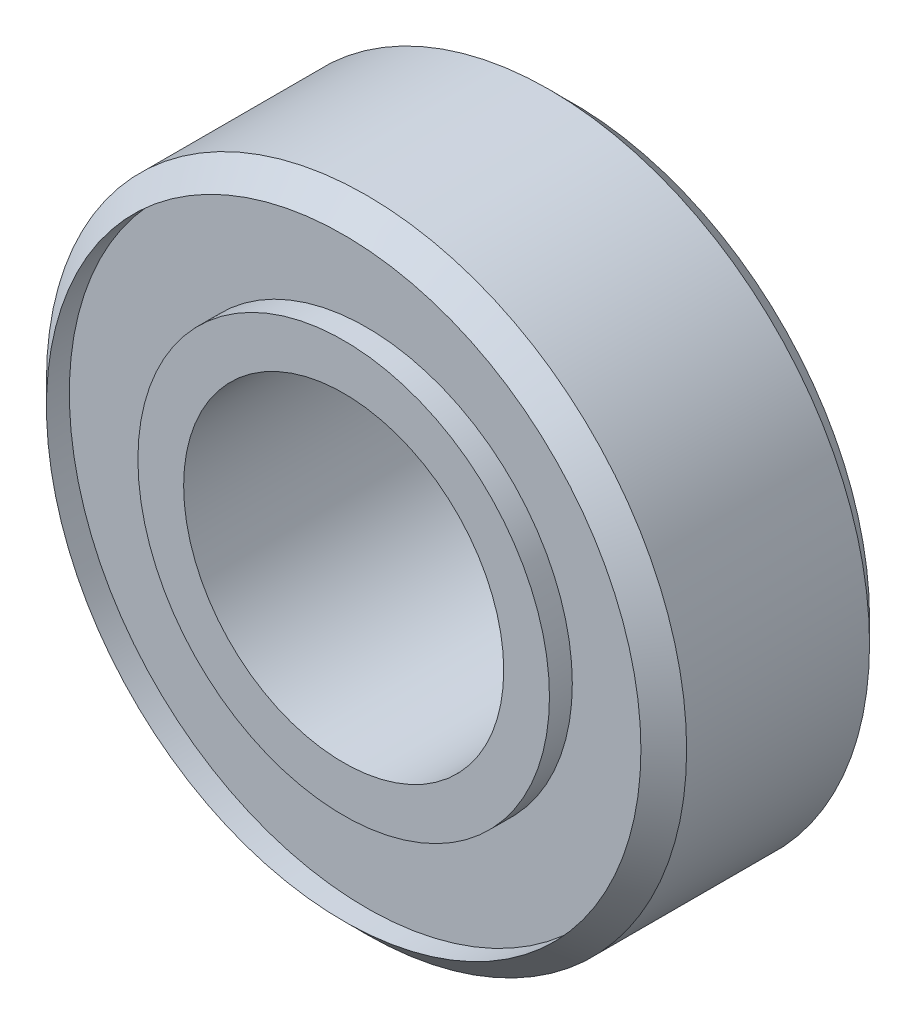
ISO-10303-21;
HEADER;
FILE_DESCRIPTION(('STEP AP214'),'2;1');
FILE_NAME('part.step','',(''),(''),'','','');
FILE_SCHEMA(('AUTOMOTIVE_DESIGN { 1 0 10303 214 1 1 1 1 }'));
ENDSEC;
DATA;
#1=APPLICATION_CONTEXT('core data for automotive mechanical design processes');
#2=APPLICATION_PROTOCOL_DEFINITION('international standard','automotive_design',2000,#1);
#3=PRODUCT_CONTEXT('',#1,'mechanical');
#4=PRODUCT('Part','Part','',(#3));
#5=PRODUCT_RELATED_PRODUCT_CATEGORY('part','',(#4));
#6=PRODUCT_DEFINITION_FORMATION('','',#4);
#7=PRODUCT_DEFINITION_CONTEXT('part definition',#1,'design');
#8=PRODUCT_DEFINITION('design','',#6,#7);
#9=PRODUCT_DEFINITION_SHAPE('','',#8);
#10=(LENGTH_UNIT() NAMED_UNIT(*) SI_UNIT(.MILLI.,.METRE.));
#11=(NAMED_UNIT(*) PLANE_ANGLE_UNIT() SI_UNIT($,.RADIAN.));
#12=(NAMED_UNIT(*) SI_UNIT($,.STERADIAN.) SOLID_ANGLE_UNIT());
#13=UNCERTAINTY_MEASURE_WITH_UNIT(LENGTH_MEASURE(1.E-05),#10,'distance_accuracy_value','');
#14=(GEOMETRIC_REPRESENTATION_CONTEXT(3) GLOBAL_UNCERTAINTY_ASSIGNED_CONTEXT((#13)) GLOBAL_UNIT_ASSIGNED_CONTEXT((#10,
#11,#12)) REPRESENTATION_CONTEXT('',''));
#15=CARTESIAN_POINT('',(0.,0.,0.));
#16=DIRECTION('',(0.,0.,1.));
#17=DIRECTION('',(1.,0.,0.));
#18=AXIS2_PLACEMENT_3D('',#15,#16,#17);
#19=CARTESIAN_POINT('',(0.,0.,0.));
#20=DIRECTION('',(0.,0.,1.));
#21=DIRECTION('',(1.,0.,0.));
#22=AXIS2_PLACEMENT_3D('',#19,#20,#21);
#23=PLANE('',#22);
#24=CARTESIAN_POINT('',(0.,0.,0.));
#25=DIRECTION('',(0.,0.,1.));
#26=DIRECTION('',(1.,0.,0.));
#27=AXIS2_PLACEMENT_3D('',#24,#25,#26);
#28=CIRCLE('',#27,3.5);
#29=CARTESIAN_POINT('',(3.5,0.,0.));
#30=VERTEX_POINT('',#29);
#31=EDGE_CURVE('E45',#30,#30,#28,.T.);
#32=ORIENTED_EDGE('',*,*,#31,.T.);
#33=EDGE_LOOP('',(#32));
#34=FACE_BOUND('',#33,.T.);
#35=CARTESIAN_POINT('',(0.,0.,0.));
#36=DIRECTION('',(0.,0.,-1.));
#37=DIRECTION('',(-1.,0.,0.));
#38=AXIS2_PLACEMENT_3D('',#35,#36,#37);
#39=CIRCLE('',#38,4.5);
#40=CARTESIAN_POINT('',(-4.5,0.,0.));
#41=VERTEX_POINT('',#40);
#42=EDGE_CURVE('E71',#41,#41,#39,.T.);
#43=ORIENTED_EDGE('',*,*,#42,.T.);
#44=EDGE_LOOP('',(#43));
#45=FACE_BOUND('',#44,.T.);
#46=ADVANCED_FACE('F30',(#34,#45),#23,.F.);
#47=CARTESIAN_POINT('',(0.,0.,5.));
#48=DIRECTION('',(0.,0.,1.));
#49=DIRECTION('',(1.,0.,0.));
#50=AXIS2_PLACEMENT_3D('',#47,#48,#49);
#51=PLANE('',#50);
#52=CARTESIAN_POINT('',(0.,0.,5.));
#53=DIRECTION('',(0.,0.,1.));
#54=DIRECTION('',(1.,0.,0.));
#55=AXIS2_PLACEMENT_3D('',#52,#53,#54);
#56=CIRCLE('',#55,3.5);
#57=CARTESIAN_POINT('',(3.5,0.,5.));
#58=VERTEX_POINT('',#57);
#59=EDGE_CURVE('E41',#58,#58,#56,.T.);
#60=ORIENTED_EDGE('',*,*,#59,.F.);
#61=EDGE_LOOP('',(#60));
#62=FACE_BOUND('',#61,.T.);
#63=CARTESIAN_POINT('',(0.,0.,5.));
#64=DIRECTION('',(0.,0.,1.));
#65=DIRECTION('',(1.,0.,0.));
#66=AXIS2_PLACEMENT_3D('',#63,#64,#65);
#67=CIRCLE('',#66,4.5);
#68=CARTESIAN_POINT('',(4.5,0.,5.));
#69=VERTEX_POINT('',#68);
#70=EDGE_CURVE('E59',#69,#69,#67,.T.);
#71=ORIENTED_EDGE('',*,*,#70,.T.);
#72=EDGE_LOOP('',(#71));
#73=FACE_BOUND('',#72,.T.);
#74=ADVANCED_FACE('F88',(#62,#73),#51,.T.);
#75=CARTESIAN_POINT('',(0.,0.,5.));
#76=DIRECTION('',(0.,0.,-1.));
#77=DIRECTION('',(-1.,0.,0.));
#78=AXIS2_PLACEMENT_3D('',#75,#76,#77);
#79=CYLINDRICAL_SURFACE('',#78,7.);
#80=CARTESIAN_POINT('',(0.,0.,0.500000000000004));
#81=DIRECTION('',(0.,0.,1.));
#82=DIRECTION('',(1.,0.,0.));
#83=AXIS2_PLACEMENT_3D('',#80,#81,#82);
#84=CIRCLE('',#83,7.);
#85=CARTESIAN_POINT('',(7.,0.,0.500000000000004));
#86=VERTEX_POINT('',#85);
#87=EDGE_CURVE('E10',#86,#86,#84,.T.);
#88=ORIENTED_EDGE('',*,*,#87,.T.);
#89=EDGE_LOOP('',(#88));
#90=FACE_BOUND('',#89,.T.);
#91=CARTESIAN_POINT('',(0.,0.,4.5));
#92=DIRECTION('',(0.,0.,1.));
#93=DIRECTION('',(1.,0.,0.));
#94=AXIS2_PLACEMENT_3D('',#91,#92,#93);
#95=CIRCLE('',#94,7.);
#96=CARTESIAN_POINT('',(7.,0.,4.5));
#97=VERTEX_POINT('',#96);
#98=EDGE_CURVE('E37',#97,#97,#95,.F.);
#99=ORIENTED_EDGE('',*,*,#98,.T.);
#100=EDGE_LOOP('',(#99));
#101=FACE_BOUND('',#100,.T.);
#102=ADVANCED_FACE('F32',(#90,#101),#79,.T.);
#103=CARTESIAN_POINT('',(0.,0.,5.));
#104=DIRECTION('',(0.,0.,-1.));
#105=DIRECTION('',(-1.,0.,0.));
#106=AXIS2_PLACEMENT_3D('',#103,#104,#105);
#107=CYLINDRICAL_SURFACE('',#106,3.5);
#108=ORIENTED_EDGE('',*,*,#59,.T.);
#109=EDGE_LOOP('',(#108));
#110=FACE_BOUND('',#109,.T.);
#111=ORIENTED_EDGE('',*,*,#31,.F.);
#112=EDGE_LOOP('',(#111));
#113=FACE_BOUND('',#112,.T.);
#114=ADVANCED_FACE('F96',(#110,#113),#107,.F.);
#115=CARTESIAN_POINT('',(0.,0.,0.500000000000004));
#116=DIRECTION('',(0.,0.,1.));
#117=DIRECTION('',(1.,0.,0.));
#118=AXIS2_PLACEMENT_3D('',#115,#116,#117);
#119=CONICAL_SURFACE('',#118,7.,0.785398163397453);
#120=CARTESIAN_POINT('',(0.,0.,0.));
#121=DIRECTION('',(0.,0.,-1.));
#122=DIRECTION('',(-1.,0.,0.));
#123=AXIS2_PLACEMENT_3D('',#120,#121,#122);
#124=CIRCLE('',#123,6.5);
#125=CARTESIAN_POINT('',(-6.5,0.,0.));
#126=VERTEX_POINT('',#125);
#127=EDGE_CURVE('E65',#126,#126,#124,.T.);
#128=ORIENTED_EDGE('',*,*,#127,.F.);
#129=EDGE_LOOP('',(#128));
#130=FACE_BOUND('',#129,.T.);
#131=ORIENTED_EDGE('',*,*,#87,.F.);
#132=EDGE_LOOP('',(#131));
#133=FACE_BOUND('',#132,.T.);
#134=ADVANCED_FACE('F99',(#130,#133),#119,.T.);
#135=CARTESIAN_POINT('',(0.,0.,5.));
#136=DIRECTION('',(0.,0.,-1.));
#137=DIRECTION('',(-1.,0.,0.));
#138=AXIS2_PLACEMENT_3D('',#135,#136,#137);
#139=CONICAL_SURFACE('',#138,6.49999999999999,0.785398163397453);
#140=ORIENTED_EDGE('',*,*,#98,.F.);
#141=EDGE_LOOP('',(#140));
#142=FACE_BOUND('',#141,.T.);
#143=CARTESIAN_POINT('',(0.,0.,5.));
#144=DIRECTION('',(0.,0.,1.));
#145=DIRECTION('',(1.,0.,0.));
#146=AXIS2_PLACEMENT_3D('',#143,#144,#145);
#147=CIRCLE('',#146,6.5);
#148=CARTESIAN_POINT('',(6.5,0.,5.));
#149=VERTEX_POINT('',#148);
#150=EDGE_CURVE('E53',#149,#149,#147,.T.);
#151=ORIENTED_EDGE('',*,*,#150,.F.);
#152=EDGE_LOOP('',(#151));
#153=FACE_BOUND('',#152,.T.);
#154=ADVANCED_FACE('F103',(#142,#153),#139,.T.);
#155=CARTESIAN_POINT('',(0.,0.,4.5));
#156=DIRECTION('',(0.,0.,1.));
#157=DIRECTION('',(1.,0.,0.));
#158=AXIS2_PLACEMENT_3D('',#155,#156,#157);
#159=CYLINDRICAL_SURFACE('',#158,6.5);
#160=CARTESIAN_POINT('',(0.,0.,4.5));
#161=DIRECTION('',(0.,0.,1.));
#162=DIRECTION('',(1.,0.,0.));
#163=AXIS2_PLACEMENT_3D('',#160,#161,#162);
#164=CIRCLE('',#163,6.5);
#165=CARTESIAN_POINT('',(6.5,0.,4.5));
#166=VERTEX_POINT('',#165);
#167=EDGE_CURVE('E50',#166,#166,#164,.T.);
#168=ORIENTED_EDGE('',*,*,#167,.F.);
#169=EDGE_LOOP('',(#168));
#170=FACE_BOUND('',#169,.T.);
#171=ORIENTED_EDGE('',*,*,#150,.T.);
#172=EDGE_LOOP('',(#171));
#173=FACE_BOUND('',#172,.T.);
#174=ADVANCED_FACE('F107',(#170,#173),#159,.F.);
#175=CARTESIAN_POINT('',(0.,0.,4.5));
#176=DIRECTION('',(0.,0.,1.));
#177=DIRECTION('',(1.,0.,0.));
#178=AXIS2_PLACEMENT_3D('',#175,#176,#177);
#179=PLANE('',#178);
#180=CARTESIAN_POINT('',(0.,0.,4.5));
#181=DIRECTION('',(0.,0.,1.));
#182=DIRECTION('',(1.,0.,0.));
#183=AXIS2_PLACEMENT_3D('',#180,#181,#182);
#184=CIRCLE('',#183,4.5);
#185=CARTESIAN_POINT('',(4.5,0.,4.5));
#186=VERTEX_POINT('',#185);
#187=EDGE_CURVE('E56',#186,#186,#184,.T.);
#188=ORIENTED_EDGE('',*,*,#187,.F.);
#189=EDGE_LOOP('',(#188));
#190=FACE_BOUND('',#189,.T.);
#191=ORIENTED_EDGE('',*,*,#167,.T.);
#192=EDGE_LOOP('',(#191));
#193=FACE_BOUND('',#192,.T.);
#194=ADVANCED_FACE('F111',(#190,#193),#179,.T.);
#195=CARTESIAN_POINT('',(0.,0.,4.5));
#196=DIRECTION('',(0.,0.,1.));
#197=DIRECTION('',(1.,0.,0.));
#198=AXIS2_PLACEMENT_3D('',#195,#196,#197);
#199=CYLINDRICAL_SURFACE('',#198,4.5);
#200=ORIENTED_EDGE('',*,*,#187,.T.);
#201=EDGE_LOOP('',(#200));
#202=FACE_BOUND('',#201,.T.);
#203=ORIENTED_EDGE('',*,*,#70,.F.);
#204=EDGE_LOOP('',(#203));
#205=FACE_BOUND('',#204,.T.);
#206=ADVANCED_FACE('F115',(#202,#205),#199,.T.);
#207=CARTESIAN_POINT('',(0.,0.,0.5));
#208=DIRECTION('',(0.,0.,-1.));
#209=DIRECTION('',(-1.,0.,0.));
#210=AXIS2_PLACEMENT_3D('',#207,#208,#209);
#211=CYLINDRICAL_SURFACE('',#210,6.5);
#212=CARTESIAN_POINT('',(0.,0.,0.5));
#213=DIRECTION('',(0.,0.,-1.));
#214=DIRECTION('',(-1.,0.,0.));
#215=AXIS2_PLACEMENT_3D('',#212,#213,#214);
#216=CIRCLE('',#215,6.5);
#217=CARTESIAN_POINT('',(-6.5,0.,0.5));
#218=VERTEX_POINT('',#217);
#219=EDGE_CURVE('E62',#218,#218,#216,.T.);
#220=ORIENTED_EDGE('',*,*,#219,.F.);
#221=EDGE_LOOP('',(#220));
#222=FACE_BOUND('',#221,.T.);
#223=ORIENTED_EDGE('',*,*,#127,.T.);
#224=EDGE_LOOP('',(#223));
#225=FACE_BOUND('',#224,.T.);
#226=ADVANCED_FACE('F84',(#222,#225),#211,.F.);
#227=CARTESIAN_POINT('',(0.,0.,0.5));
#228=DIRECTION('',(0.,0.,-1.));
#229=DIRECTION('',(-1.,0.,0.));
#230=AXIS2_PLACEMENT_3D('',#227,#228,#229);
#231=PLANE('',#230);
#232=CARTESIAN_POINT('',(0.,0.,0.5));
#233=DIRECTION('',(0.,0.,-1.));
#234=DIRECTION('',(-1.,0.,0.));
#235=AXIS2_PLACEMENT_3D('',#232,#233,#234);
#236=CIRCLE('',#235,4.5);
#237=CARTESIAN_POINT('',(-4.5,0.,0.5));
#238=VERTEX_POINT('',#237);
#239=EDGE_CURVE('E68',#238,#238,#236,.T.);
#240=ORIENTED_EDGE('',*,*,#239,.F.);
#241=EDGE_LOOP('',(#240));
#242=FACE_BOUND('',#241,.T.);
#243=ORIENTED_EDGE('',*,*,#219,.T.);
#244=EDGE_LOOP('',(#243));
#245=FACE_BOUND('',#244,.T.);
#246=ADVANCED_FACE('F78',(#242,#245),#231,.T.);
#247=CARTESIAN_POINT('',(0.,0.,0.5));
#248=DIRECTION('',(0.,0.,-1.));
#249=DIRECTION('',(-1.,0.,0.));
#250=AXIS2_PLACEMENT_3D('',#247,#248,#249);
#251=CYLINDRICAL_SURFACE('',#250,4.5);
#252=ORIENTED_EDGE('',*,*,#239,.T.);
#253=EDGE_LOOP('',(#252));
#254=FACE_BOUND('',#253,.T.);
#255=ORIENTED_EDGE('',*,*,#42,.F.);
#256=EDGE_LOOP('',(#255));
#257=FACE_BOUND('',#256,.T.);
#258=ADVANCED_FACE('F76',(#254,#257),#251,.T.);
#259=CLOSED_SHELL('',(#46,#74,#102,#114,#134,#154,#174,#194,#206,#226,#246,#258));
#260=MANIFOLD_SOLID_BREP('B2',#259);
#261=ADVANCED_BREP_SHAPE_REPRESENTATION('',(#18,#260),#14);
#262=SHAPE_DEFINITION_REPRESENTATION(#9,#261);
ENDSEC;
END-ISO-10303-21;
